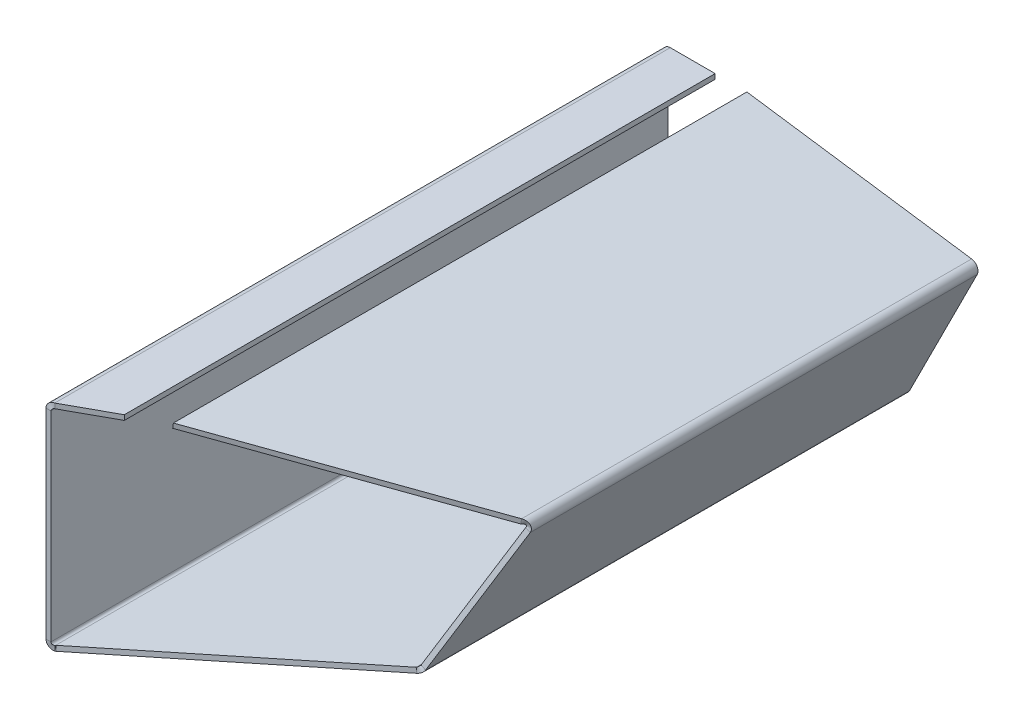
ISO-10303-21;
HEADER;
FILE_DESCRIPTION(('STEP AP214'),'2;1');
FILE_NAME('part.step','',(''),(''),'','','');
FILE_SCHEMA(('AUTOMOTIVE_DESIGN { 1 0 10303 214 1 1 1 1 }'));
ENDSEC;
DATA;
#1=APPLICATION_CONTEXT('core data for automotive mechanical design processes');
#2=APPLICATION_PROTOCOL_DEFINITION('international standard','automotive_design',2000,#1);
#3=PRODUCT_CONTEXT('',#1,'mechanical');
#4=PRODUCT('Part','Part','',(#3));
#5=PRODUCT_RELATED_PRODUCT_CATEGORY('part','',(#4));
#6=PRODUCT_DEFINITION_FORMATION('','',#4);
#7=PRODUCT_DEFINITION_CONTEXT('part definition',#1,'design');
#8=PRODUCT_DEFINITION('design','',#6,#7);
#9=PRODUCT_DEFINITION_SHAPE('','',#8);
#10=(LENGTH_UNIT() NAMED_UNIT(*) SI_UNIT(.MILLI.,.METRE.));
#11=(NAMED_UNIT(*) PLANE_ANGLE_UNIT() SI_UNIT($,.RADIAN.));
#12=(NAMED_UNIT(*) SI_UNIT($,.STERADIAN.) SOLID_ANGLE_UNIT());
#13=UNCERTAINTY_MEASURE_WITH_UNIT(LENGTH_MEASURE(1.E-05),#10,'distance_accuracy_value','');
#14=(GEOMETRIC_REPRESENTATION_CONTEXT(3) GLOBAL_UNCERTAINTY_ASSIGNED_CONTEXT((#13)) GLOBAL_UNIT_ASSIGNED_CONTEXT((#10,
#11,#12)) REPRESENTATION_CONTEXT('',''));
#15=CARTESIAN_POINT('',(0.,0.,0.));
#16=DIRECTION('',(0.,0.,1.));
#17=DIRECTION('',(1.,0.,0.));
#18=AXIS2_PLACEMENT_3D('',#15,#16,#17);
#19=CARTESIAN_POINT('',(123.998316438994,71.6559930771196,-268.));
#20=DIRECTION('',(0.141944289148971,0.989874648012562,0.));
#21=DIRECTION('',(-0.989874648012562,0.141944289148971,0.));
#22=AXIS2_PLACEMENT_3D('',#19,#20,#21);
#23=PLANE('',#22);
#24=DIRECTION('',(0.,0.,1.));
#25=VECTOR('',#24,1.);
#26=CARTESIAN_POINT('',(31.9075204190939,84.8614657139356,-268.));
#27=LINE('',#26,#25);
#28=CARTESIAN_POINT('',(31.9075204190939,84.8614657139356,-268.));
#29=VERTEX_POINT('',#28);
#30=CARTESIAN_POINT('',(31.9075204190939,84.8614657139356,-36.5449664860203));
#31=VERTEX_POINT('',#30);
#32=EDGE_CURVE('E225',#29,#31,#27,.T.);
#33=ORIENTED_EDGE('',*,*,#32,.T.);
#34=DIRECTION('',(-0.869721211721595,0.12471473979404,0.477526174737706));
#35=VECTOR('',#34,1.);
#36=CARTESIAN_POINT('',(199.125402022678,60.8830525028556,-128.357048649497));
#37=LINE('',#36,#35);
#38=CARTESIAN_POINT('',(122.622107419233,71.8533362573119,-86.3524095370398));
#39=VERTEX_POINT('',#38);
#40=EDGE_CURVE('E50',#39,#31,#37,.T.);
#41=ORIENTED_EDGE('',*,*,#40,.F.);
#42=DIRECTION('',(0.,0.,1.));
#43=VECTOR('',#42,1.);
#44=CARTESIAN_POINT('',(122.622107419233,71.8533362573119,-268.));
#45=LINE('',#44,#43);
#46=CARTESIAN_POINT('',(122.622107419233,71.8533362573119,-268.));
#47=VERTEX_POINT('',#46);
#48=EDGE_CURVE('E231',#47,#39,#45,.T.);
#49=ORIENTED_EDGE('',*,*,#48,.F.);
#50=DIRECTION('',(-0.989874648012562,0.141944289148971,0.));
#51=VECTOR('',#50,1.);
#52=CARTESIAN_POINT('',(123.998316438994,71.6559930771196,-268.));
#53=LINE('',#52,#51);
#54=EDGE_CURVE('E200',#47,#29,#53,.T.);
#55=ORIENTED_EDGE('',*,*,#54,.T.);
#56=EDGE_LOOP('',(#33,#41,#49,#55));
#57=FACE_BOUND('',#56,.T.);
#58=ADVANCED_FACE('F35',(#57),#23,.T.);
#59=CARTESIAN_POINT('',(122.196274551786,68.8837123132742,-268.));
#60=DIRECTION('',(0.,0.,1.));
#61=DIRECTION('',(1.,0.,0.));
#62=AXIS2_PLACEMENT_3D('',#59,#60,#61);
#63=CYLINDRICAL_SURFACE('',#62,3.);
#64=ORIENTED_EDGE('',*,*,#48,.T.);
#65=CARTESIAN_POINT('',(122.196274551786,68.8837123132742,-86.1186031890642));
#66=DIRECTION('',(-0.481283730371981,0.,-0.876564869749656));
#67=DIRECTION('',(-0.876564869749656,0.,0.481283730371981));
#68=AXIS2_PLACEMENT_3D('',#65,#66,#67);
#69=ELLIPSE('',#68,3.42245064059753,3.);
#70=CARTESIAN_POINT('',(124.87621874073,67.5354174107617,-87.590044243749));
#71=VERTEX_POINT('',#70);
#72=EDGE_CURVE('E190',#71,#39,#69,.F.);
#73=ORIENTED_EDGE('',*,*,#72,.F.);
#74=DIRECTION('',(0.,0.,1.));
#75=VECTOR('',#74,1.);
#76=CARTESIAN_POINT('',(124.87621874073,67.5354174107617,-268.));
#77=LINE('',#76,#75);
#78=CARTESIAN_POINT('',(124.87621874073,67.5354174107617,-268.));
#79=VERTEX_POINT('',#78);
#80=EDGE_CURVE('E307',#79,#71,#77,.T.);
#81=ORIENTED_EDGE('',*,*,#80,.F.);
#82=CARTESIAN_POINT('',(122.196274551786,68.8837123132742,-268.));
#83=DIRECTION('',(0.,0.,1.));
#84=DIRECTION('',(1.,0.,0.));
#85=AXIS2_PLACEMENT_3D('',#82,#83,#84);
#86=CIRCLE('',#85,3.);
#87=EDGE_CURVE('E228',#79,#47,#86,.T.);
#88=ORIENTED_EDGE('',*,*,#87,.T.);
#89=EDGE_LOOP('',(#64,#73,#81,#88));
#90=FACE_BOUND('',#89,.T.);
#91=ADVANCED_FACE('F471',(#90),#63,.T.);
#92=CARTESIAN_POINT('',(97.3525498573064,12.8278780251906,-268.));
#93=DIRECTION('',(0.893314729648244,-0.449431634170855,0.));
#94=DIRECTION('',(0.449431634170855,0.893314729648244,0.));
#95=AXIS2_PLACEMENT_3D('',#92,#93,#94);
#96=PLANE('',#95);
#97=ORIENTED_EDGE('',*,*,#80,.T.);
#98=DIRECTION('',(0.436343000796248,0.867299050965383,-0.239577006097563));
#99=VECTOR('',#98,1.);
#100=CARTESIAN_POINT('',(117.79198059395,53.4544008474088,-83.7003965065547));
#101=LINE('',#100,#99);
#102=CARTESIAN_POINT('',(97.5871023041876,13.2940872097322,-72.6067746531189));
#103=VERTEX_POINT('',#102);
#104=EDGE_CURVE('E199',#103,#71,#101,.T.);
#105=ORIENTED_EDGE('',*,*,#104,.F.);
#106=DIRECTION('',(0.,0.,1.));
#107=VECTOR('',#106,1.);
#108=CARTESIAN_POINT('',(97.5871023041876,13.2940872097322,-268.));
#109=LINE('',#108,#107);
#110=CARTESIAN_POINT('',(97.5871023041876,13.2940872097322,-268.));
#111=VERTEX_POINT('',#110);
#112=EDGE_CURVE('E310',#111,#103,#109,.T.);
#113=ORIENTED_EDGE('',*,*,#112,.F.);
#114=DIRECTION('',(0.449431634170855,0.893314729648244,0.));
#115=VECTOR('',#114,1.);
#116=CARTESIAN_POINT('',(97.3525498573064,12.8278780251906,-268.));
#117=LINE('',#116,#115);
#118=EDGE_CURVE('E300',#111,#79,#117,.T.);
#119=ORIENTED_EDGE('',*,*,#118,.T.);
#120=EDGE_LOOP('',(#97,#105,#113,#119));
#121=FACE_BOUND('',#120,.T.);
#122=ADVANCED_FACE('F477',(#121),#96,.T.);
#123=CARTESIAN_POINT('',(94.9071581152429,14.6423821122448,-268.));
#124=DIRECTION('',(0.,0.,1.));
#125=DIRECTION('',(1.,0.,0.));
#126=AXIS2_PLACEMENT_3D('',#123,#124,#125);
#127=CYLINDRICAL_SURFACE('',#126,3.);
#128=ORIENTED_EDGE('',*,*,#112,.T.);
#129=CARTESIAN_POINT('',(94.9071581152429,14.6423821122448,-71.1353335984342));
#130=DIRECTION('',(-0.481283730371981,0.,-0.876564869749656));
#131=DIRECTION('',(-0.876564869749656,0.,0.481283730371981));
#132=AXIS2_PLACEMENT_3D('',#129,#130,#131);
#133=ELLIPSE('',#132,3.42245064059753,3.);
#134=CARTESIAN_POINT('',(95.3336896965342,11.6728584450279,-71.3695235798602));
#135=VERTEX_POINT('',#134);
#136=EDGE_CURVE('E519',#135,#103,#133,.F.);
#137=ORIENTED_EDGE('',*,*,#136,.F.);
#138=DIRECTION('',(0.,0.,1.));
#139=VECTOR('',#138,1.);
#140=CARTESIAN_POINT('',(95.3336896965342,11.6728584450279,-268.));
#141=LINE('',#140,#139);
#142=CARTESIAN_POINT('',(95.3336896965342,11.6728584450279,-268.));
#143=VERTEX_POINT('',#142);
#144=EDGE_CURVE('E313',#143,#135,#141,.T.);
#145=ORIENTED_EDGE('',*,*,#144,.F.);
#146=CARTESIAN_POINT('',(94.9071581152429,14.6423821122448,-268.));
#147=DIRECTION('',(0.,0.,1.));
#148=DIRECTION('',(1.,0.,0.));
#149=AXIS2_PLACEMENT_3D('',#146,#147,#148);
#150=CIRCLE('',#149,3.);
#151=EDGE_CURVE('E297',#143,#111,#150,.T.);
#152=ORIENTED_EDGE('',*,*,#151,.T.);
#153=EDGE_LOOP('',(#128,#137,#145,#152));
#154=FACE_BOUND('',#153,.T.);
#155=ADVANCED_FACE('F608',(#154),#127,.T.);
#156=CARTESIAN_POINT('',(0.284354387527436,-1.97968244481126,-268.));
#157=DIRECTION('',(0.142177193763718,-0.989841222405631,0.));
#158=DIRECTION('',(0.989841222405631,0.142177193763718,0.));
#159=AXIS2_PLACEMENT_3D('',#156,#157,#158);
#160=PLANE('',#159);
#161=ORIENTED_EDGE('',*,*,#144,.T.);
#162=DIRECTION('',(0.869698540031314,0.124920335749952,-0.477513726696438));
#163=VECTOR('',#162,1.);
#164=CARTESIAN_POINT('',(103.616701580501,12.8626001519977,-75.9173659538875));
#165=LINE('',#164,#163);
#166=CARTESIAN_POINT('',(1.42653158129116,-1.81562426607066,-19.8091782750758));
#167=VERTEX_POINT('',#166);
#168=EDGE_CURVE('E359',#167,#135,#165,.T.);
#169=ORIENTED_EDGE('',*,*,#168,.F.);
#170=DIRECTION('',(0.,0.,1.));
#171=VECTOR('',#170,1.);
#172=CARTESIAN_POINT('',(1.42653158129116,-1.81562426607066,-268.));
#173=LINE('',#172,#171);
#174=CARTESIAN_POINT('',(1.42653158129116,-1.81562426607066,-268.));
#175=VERTEX_POINT('',#174);
#176=EDGE_CURVE('E316',#175,#167,#173,.T.);
#177=ORIENTED_EDGE('',*,*,#176,.F.);
#178=DIRECTION('',(0.989841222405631,0.142177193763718,0.));
#179=VECTOR('',#178,1.);
#180=CARTESIAN_POINT('',(0.284354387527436,-1.97968244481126,-268.));
#181=LINE('',#180,#179);
#182=EDGE_CURVE('E294',#175,#143,#181,.T.);
#183=ORIENTED_EDGE('',*,*,#182,.T.);
#184=EDGE_LOOP('',(#161,#169,#177,#183));
#185=FACE_BOUND('',#184,.T.);
#186=ADVANCED_FACE('F529',(#185),#160,.T.);
#187=CARTESIAN_POINT('',(1.,1.15389940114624,-268.));
#188=DIRECTION('',(0.,0.,1.));
#189=DIRECTION('',(1.,0.,0.));
#190=AXIS2_PLACEMENT_3D('',#187,#188,#189);
#191=CYLINDRICAL_SURFACE('',#190,3.);
#192=ORIENTED_EDGE('',*,*,#176,.T.);
#193=CARTESIAN_POINT('',(1.,1.15389940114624,-19.5749882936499));
#194=DIRECTION('',(-0.481283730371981,0.,-0.876564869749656));
#195=DIRECTION('',(-0.876564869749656,0.,0.481283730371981));
#196=AXIS2_PLACEMENT_3D('',#193,#194,#195);
#197=ELLIPSE('',#196,3.42245064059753,3.);
#198=CARTESIAN_POINT('',(1.00000000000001,-1.84610059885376,-19.5749882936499));
#199=VERTEX_POINT('',#198);
#200=EDGE_CURVE('E398',#199,#167,#197,.F.);
#201=ORIENTED_EDGE('',*,*,#200,.F.);
#202=CARTESIAN_POINT('',(1.,1.15389940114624,-19.5749882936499));
#203=DIRECTION('',(-0.180028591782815,0.,-0.983661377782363));
#204=DIRECTION('',(-0.983661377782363,0.,0.180028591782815));
#205=AXIS2_PLACEMENT_3D('',#202,#203,#204);
#206=ELLIPSE('',#205,3.04983002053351,3.);
#207=CARTESIAN_POINT('',(-2.,1.15389940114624,-19.0259316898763));
#208=VERTEX_POINT('',#207);
#209=EDGE_CURVE('E534',#208,#199,#206,.F.);
#210=ORIENTED_EDGE('',*,*,#209,.F.);
#211=DIRECTION('',(0.,0.,1.));
#212=VECTOR('',#211,1.);
#213=CARTESIAN_POINT('',(-2.,1.15389940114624,-268.));
#214=LINE('',#213,#212);
#215=CARTESIAN_POINT('',(-2.,1.15389940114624,-268.));
#216=VERTEX_POINT('',#215);
#217=EDGE_CURVE('E319',#216,#208,#214,.T.);
#218=ORIENTED_EDGE('',*,*,#217,.F.);
#219=CARTESIAN_POINT('',(1.,1.15389940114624,-268.));
#220=DIRECTION('',(0.,0.,1.));
#221=DIRECTION('',(1.,0.,0.));
#222=AXIS2_PLACEMENT_3D('',#219,#220,#221);
#223=CIRCLE('',#222,3.);
#224=EDGE_CURVE('E291',#216,#175,#223,.T.);
#225=ORIENTED_EDGE('',*,*,#224,.T.);
#226=EDGE_LOOP('',(#192,#201,#210,#218,#225));
#227=FACE_BOUND('',#226,.T.);
#228=ADVANCED_FACE('F533',(#227),#191,.T.);
#229=CARTESIAN_POINT('',(-2.,82.8817164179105,-268.));
#230=DIRECTION('',(-1.,0.,0.));
#231=DIRECTION('',(0.,0.,1.));
#232=AXIS2_PLACEMENT_3D('',#229,#230,#231);
#233=PLANE('',#232);
#234=ORIENTED_EDGE('',*,*,#217,.T.);
#235=DIRECTION('',(0.,1.,0.));
#236=VECTOR('',#235,1.);
#237=CARTESIAN_POINT('',(-2.,82.8817164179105,-19.0259316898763));
#238=LINE('',#237,#236);
#239=CARTESIAN_POINT('',(-2.,81.8817164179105,-19.0259316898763));
#240=VERTEX_POINT('',#239);
#241=EDGE_CURVE('E425',#240,#208,#238,.F.);
#242=ORIENTED_EDGE('',*,*,#241,.F.);
#243=DIRECTION('',(0.,0.,1.));
#244=VECTOR('',#243,1.);
#245=CARTESIAN_POINT('',(-2.,81.8817164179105,-268.));
#246=LINE('',#245,#244);
#247=CARTESIAN_POINT('',(-2.,81.8817164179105,-268.));
#248=VERTEX_POINT('',#247);
#249=EDGE_CURVE('E322',#248,#240,#246,.T.);
#250=ORIENTED_EDGE('',*,*,#249,.F.);
#251=DIRECTION('',(0.,1.,0.));
#252=VECTOR('',#251,1.);
#253=CARTESIAN_POINT('',(-2.,82.8817164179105,-268.));
#254=LINE('',#253,#252);
#255=EDGE_CURVE('E249',#248,#216,#254,.F.);
#256=ORIENTED_EDGE('',*,*,#255,.T.);
#257=EDGE_LOOP('',(#234,#242,#250,#256));
#258=FACE_BOUND('',#257,.T.);
#259=ADVANCED_FACE('F439',(#258),#233,.T.);
#260=CARTESIAN_POINT('',(1.,81.8817164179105,-268.));
#261=DIRECTION('',(0.,0.,1.));
#262=DIRECTION('',(1.,0.,0.));
#263=AXIS2_PLACEMENT_3D('',#260,#261,#262);
#264=CYLINDRICAL_SURFACE('',#263,3.);
#265=ORIENTED_EDGE('',*,*,#249,.T.);
#266=CARTESIAN_POINT('',(1.,81.8817164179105,-19.5749882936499));
#267=DIRECTION('',(-0.180028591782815,0.,-0.983661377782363));
#268=DIRECTION('',(-0.983661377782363,0.,0.180028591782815));
#269=AXIS2_PLACEMENT_3D('',#266,#267,#268);
#270=ELLIPSE('',#269,3.04983002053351,3.);
#271=CARTESIAN_POINT('',(1.,84.8817164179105,-19.5749882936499));
#272=VERTEX_POINT('',#271);
#273=EDGE_CURVE('E400',#272,#240,#270,.F.);
#274=ORIENTED_EDGE('',*,*,#273,.F.);
#275=DIRECTION('',(0.,0.,1.));
#276=VECTOR('',#275,1.);
#277=CARTESIAN_POINT('',(1.,84.8817164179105,-268.));
#278=LINE('',#277,#276);
#279=CARTESIAN_POINT('',(1.,84.8817164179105,-268.));
#280=VERTEX_POINT('',#279);
#281=EDGE_CURVE('E325',#280,#272,#278,.T.);
#282=ORIENTED_EDGE('',*,*,#281,.F.);
#283=CARTESIAN_POINT('',(1.,81.8817164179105,-268.));
#284=DIRECTION('',(0.,0.,1.));
#285=DIRECTION('',(1.,0.,0.));
#286=AXIS2_PLACEMENT_3D('',#283,#284,#285);
#287=CIRCLE('',#286,3.);
#288=EDGE_CURVE('E288',#280,#248,#287,.T.);
#289=ORIENTED_EDGE('',*,*,#288,.T.);
#290=EDGE_LOOP('',(#265,#274,#282,#289));
#291=FACE_BOUND('',#290,.T.);
#292=ADVANCED_FACE('F443',(#291),#264,.T.);
#293=CARTESIAN_POINT('',(19.113184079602,84.8817164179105,-268.));
#294=DIRECTION('',(0.,1.,0.));
#295=DIRECTION('',(0.,0.,1.));
#296=AXIS2_PLACEMENT_3D('',#293,#294,#295);
#297=PLANE('',#296);
#298=ORIENTED_EDGE('',*,*,#281,.T.);
#299=DIRECTION('',(-0.876564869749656,0.,0.481283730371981));
#300=VECTOR('',#299,1.);
#301=CARTESIAN_POINT('',(119.722206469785,84.8817164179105,-84.7601997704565));
#302=LINE('',#301,#300);
#303=CARTESIAN_POINT('',(19.113184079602,84.8817164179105,-29.5201516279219));
#304=VERTEX_POINT('',#303);
#305=EDGE_CURVE('E412',#304,#272,#302,.T.);
#306=ORIENTED_EDGE('',*,*,#305,.F.);
#307=DIRECTION('',(0.,0.,1.));
#308=VECTOR('',#307,1.);
#309=CARTESIAN_POINT('',(19.113184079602,84.8817164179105,-268.));
#310=LINE('',#309,#308);
#311=CARTESIAN_POINT('',(19.113184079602,84.8817164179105,-268.));
#312=VERTEX_POINT('',#311);
#313=EDGE_CURVE('E328',#312,#304,#310,.T.);
#314=ORIENTED_EDGE('',*,*,#313,.F.);
#315=DIRECTION('',(1.,0.,0.));
#316=VECTOR('',#315,1.);
#317=CARTESIAN_POINT('',(19.113184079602,84.8817164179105,-268.));
#318=LINE('',#317,#316);
#319=EDGE_CURVE('E285',#312,#280,#318,.F.);
#320=ORIENTED_EDGE('',*,*,#319,.T.);
#321=EDGE_LOOP('',(#298,#306,#314,#320));
#322=FACE_BOUND('',#321,.T.);
#323=ADVANCED_FACE('F447',(#322),#297,.T.);
#324=CARTESIAN_POINT('',(19.113184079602,84.8817164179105,-268.));
#325=DIRECTION('',(-1.,0.,0.));
#326=DIRECTION('',(0.,0.,1.));
#327=AXIS2_PLACEMENT_3D('',#324,#325,#326);
#328=PLANE('',#327);
#329=DIRECTION('',(0.,1.,0.));
#330=VECTOR('',#329,1.);
#331=CARTESIAN_POINT('',(19.113184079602,84.8817164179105,-29.5201516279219));
#332=LINE('',#331,#330);
#333=CARTESIAN_POINT('',(19.113184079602,82.8817164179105,-29.5201516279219));
#334=VERTEX_POINT('',#333);
#335=EDGE_CURVE('E417',#304,#334,#332,.F.);
#336=ORIENTED_EDGE('',*,*,#335,.T.);
#337=DIRECTION('',(0.,0.,1.));
#338=VECTOR('',#337,1.);
#339=CARTESIAN_POINT('',(19.113184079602,82.8817164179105,-268.));
#340=LINE('',#339,#338);
#341=CARTESIAN_POINT('',(19.113184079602,82.8817164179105,-268.));
#342=VERTEX_POINT('',#341);
#343=EDGE_CURVE('E331',#342,#334,#340,.T.);
#344=ORIENTED_EDGE('',*,*,#343,.F.);
#345=DIRECTION('',(0.,-1.,0.));
#346=VECTOR('',#345,1.);
#347=CARTESIAN_POINT('',(19.113184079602,84.8817164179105,-268.));
#348=LINE('',#347,#346);
#349=EDGE_CURVE('E283',#312,#342,#348,.T.);
#350=ORIENTED_EDGE('',*,*,#349,.F.);
#351=ORIENTED_EDGE('',*,*,#313,.T.);
#352=EDGE_LOOP('',(#336,#344,#350,#351));
#353=FACE_BOUND('',#352,.T.);
#354=ADVANCED_FACE('F461',(#353),#328,.F.);
#355=CARTESIAN_POINT('',(19.113184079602,82.8817164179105,-268.));
#356=DIRECTION('',(0.,1.,0.));
#357=DIRECTION('',(0.,0.,1.));
#358=AXIS2_PLACEMENT_3D('',#355,#356,#357);
#359=PLANE('',#358);
#360=DIRECTION('',(-0.876564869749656,0.,0.481283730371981));
#361=VECTOR('',#360,1.);
#362=CARTESIAN_POINT('',(119.722206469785,82.8817164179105,-84.7601997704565));
#363=LINE('',#362,#361);
#364=CARTESIAN_POINT('',(1.,82.8817164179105,-19.5749882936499));
#365=VERTEX_POINT('',#364);
#366=EDGE_CURVE('E414',#334,#365,#363,.T.);
#367=ORIENTED_EDGE('',*,*,#366,.T.);
#368=DIRECTION('',(0.,0.,1.));
#369=VECTOR('',#368,1.);
#370=CARTESIAN_POINT('',(1.,82.8817164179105,-268.));
#371=LINE('',#370,#369);
#372=CARTESIAN_POINT('',(1.,82.8817164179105,-268.));
#373=VERTEX_POINT('',#372);
#374=EDGE_CURVE('E269',#373,#365,#371,.T.);
#375=ORIENTED_EDGE('',*,*,#374,.F.);
#376=DIRECTION('',(-1.,0.,0.));
#377=VECTOR('',#376,1.);
#378=CARTESIAN_POINT('',(19.113184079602,82.8817164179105,-268.));
#379=LINE('',#378,#377);
#380=EDGE_CURVE('E260',#342,#373,#379,.T.);
#381=ORIENTED_EDGE('',*,*,#380,.F.);
#382=ORIENTED_EDGE('',*,*,#343,.T.);
#383=EDGE_LOOP('',(#367,#375,#381,#382));
#384=FACE_BOUND('',#383,.T.);
#385=ADVANCED_FACE('F456',(#384),#359,.F.);
#386=CARTESIAN_POINT('',(1.,81.8817164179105,-268.));
#387=DIRECTION('',(0.,0.,1.));
#388=DIRECTION('',(1.,0.,0.));
#389=AXIS2_PLACEMENT_3D('',#386,#387,#388);
#390=CYLINDRICAL_SURFACE('',#389,1.);
#391=CARTESIAN_POINT('',(1.,81.8817164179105,-19.5749882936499));
#392=DIRECTION('',(-0.481283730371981,0.,-0.876564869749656));
#393=DIRECTION('',(-0.876564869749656,0.,0.481283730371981));
#394=AXIS2_PLACEMENT_3D('',#391,#392,#393);
#395=ELLIPSE('',#394,1.14081688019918,1.);
#396=CARTESIAN_POINT('',(0.,81.8817164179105,-19.0259316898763));
#397=VERTEX_POINT('',#396);
#398=EDGE_CURVE('E266',#365,#397,#395,.F.);
#399=ORIENTED_EDGE('',*,*,#398,.T.);
#400=DIRECTION('',(0.,0.,1.));
#401=VECTOR('',#400,1.);
#402=CARTESIAN_POINT('',(0.,81.8817164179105,-268.));
#403=LINE('',#402,#401);
#404=CARTESIAN_POINT('',(0.,81.8817164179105,-268.));
#405=VERTEX_POINT('',#404);
#406=EDGE_CURVE('E264',#405,#397,#403,.T.);
#407=ORIENTED_EDGE('',*,*,#406,.F.);
#408=CARTESIAN_POINT('',(1.,81.8817164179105,-268.));
#409=DIRECTION('',(0.,0.,-1.));
#410=DIRECTION('',(-1.,0.,0.));
#411=AXIS2_PLACEMENT_3D('',#408,#409,#410);
#412=CIRCLE('',#411,1.);
#413=EDGE_CURVE('E255',#373,#405,#412,.F.);
#414=ORIENTED_EDGE('',*,*,#413,.F.);
#415=ORIENTED_EDGE('',*,*,#374,.T.);
#416=EDGE_LOOP('',(#399,#407,#414,#415));
#417=FACE_BOUND('',#416,.T.);
#418=ADVANCED_FACE('F265',(#417),#390,.F.);
#419=CARTESIAN_POINT('',(0.,82.8817164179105,-268.));
#420=DIRECTION('',(-1.,0.,0.));
#421=DIRECTION('',(0.,0.,1.));
#422=AXIS2_PLACEMENT_3D('',#419,#420,#421);
#423=PLANE('',#422);
#424=DIRECTION('',(0.,-1.,0.));
#425=VECTOR('',#424,1.);
#426=CARTESIAN_POINT('',(0.,82.8817164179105,-19.0259316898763));
#427=LINE('',#426,#425);
#428=CARTESIAN_POINT('',(0.,1.15389940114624,-19.0259316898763));
#429=VERTEX_POINT('',#428);
#430=EDGE_CURVE('E422',#397,#429,#427,.T.);
#431=ORIENTED_EDGE('',*,*,#430,.T.);
#432=DIRECTION('',(0.,0.,1.));
#433=VECTOR('',#432,1.);
#434=CARTESIAN_POINT('',(0.,1.15389940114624,-268.));
#435=LINE('',#434,#433);
#436=CARTESIAN_POINT('',(0.,1.15389940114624,-268.));
#437=VERTEX_POINT('',#436);
#438=EDGE_CURVE('E270',#437,#429,#435,.T.);
#439=ORIENTED_EDGE('',*,*,#438,.F.);
#440=DIRECTION('',(0.,-1.,0.));
#441=VECTOR('',#440,1.);
#442=CARTESIAN_POINT('',(0.,82.8817164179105,-268.));
#443=LINE('',#442,#441);
#444=EDGE_CURVE('E246',#405,#437,#443,.T.);
#445=ORIENTED_EDGE('',*,*,#444,.F.);
#446=ORIENTED_EDGE('',*,*,#406,.T.);
#447=EDGE_LOOP('',(#431,#439,#445,#446));
#448=FACE_BOUND('',#447,.T.);
#449=ADVANCED_FACE('F272',(#448),#423,.F.);
#450=CARTESIAN_POINT('',(1.,1.15389940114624,-268.));
#451=DIRECTION('',(0.,0.,1.));
#452=DIRECTION('',(1.,0.,0.));
#453=AXIS2_PLACEMENT_3D('',#450,#451,#452);
#454=CYLINDRICAL_SURFACE('',#453,1.);
#455=CARTESIAN_POINT('',(1.,1.15389940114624,-19.5749882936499));
#456=DIRECTION('',(-0.854803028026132,0.,-0.518952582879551));
#457=DIRECTION('',(-0.518952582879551,0.,0.854803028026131));
#458=AXIS2_PLACEMENT_3D('',#455,#456,#457);
#459=ELLIPSE('',#458,1.92695832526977,1.);
#460=CARTESIAN_POINT('',(1.00000000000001,0.15389940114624,-19.5749882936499));
#461=VERTEX_POINT('',#460);
#462=CARTESIAN_POINT('',(1.14217719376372,0.164058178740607,-19.8091782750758));
#463=VERTEX_POINT('',#462);
#464=EDGE_CURVE('E394',#461,#463,#459,.F.);
#465=ORIENTED_EDGE('',*,*,#464,.T.);
#466=DIRECTION('',(0.,0.,1.));
#467=VECTOR('',#466,1.);
#468=CARTESIAN_POINT('',(1.14217719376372,0.164058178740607,-268.));
#469=LINE('',#468,#467);
#470=CARTESIAN_POINT('',(1.14217719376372,0.164058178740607,-268.));
#471=VERTEX_POINT('',#470);
#472=EDGE_CURVE('E336',#471,#463,#469,.T.);
#473=ORIENTED_EDGE('',*,*,#472,.F.);
#474=CARTESIAN_POINT('',(1.,1.15389940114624,-268.));
#475=DIRECTION('',(0.,0.,-1.));
#476=DIRECTION('',(-1.,0.,0.));
#477=AXIS2_PLACEMENT_3D('',#474,#475,#476);
#478=CIRCLE('',#477,1.);
#479=EDGE_CURVE('E275',#437,#471,#478,.F.);
#480=ORIENTED_EDGE('',*,*,#479,.F.);
#481=ORIENTED_EDGE('',*,*,#438,.T.);
#482=CARTESIAN_POINT('',(1.,1.15389940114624,-19.5749882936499));
#483=DIRECTION('',(-0.481283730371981,0.,-0.876564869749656));
#484=DIRECTION('',(-0.876564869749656,0.,0.481283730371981));
#485=AXIS2_PLACEMENT_3D('',#482,#483,#484);
#486=ELLIPSE('',#485,1.14081688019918,1.);
#487=EDGE_CURVE('E395',#429,#461,#486,.F.);
#488=ORIENTED_EDGE('',*,*,#487,.T.);
#489=EDGE_LOOP('',(#465,#473,#480,#481,#488));
#490=FACE_BOUND('',#489,.T.);
#491=ADVANCED_FACE('F392',(#490),#454,.F.);
#492=CARTESIAN_POINT('',(0.,0.,-268.));
#493=DIRECTION('',(0.142177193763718,-0.989841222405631,0.));
#494=DIRECTION('',(0.989841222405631,0.142177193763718,0.));
#495=AXIS2_PLACEMENT_3D('',#492,#493,#494);
#496=PLANE('',#495);
#497=DIRECTION('',(0.869698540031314,0.124920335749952,-0.477513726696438));
#498=VECTOR('',#497,1.);
#499=CARTESIAN_POINT('',(103.332347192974,14.842282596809,-75.9173659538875));
#500=LINE('',#499,#498);
#501=CARTESIAN_POINT('',(95.0493353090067,13.6525408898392,-71.3695235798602));
#502=VERTEX_POINT('',#501);
#503=EDGE_CURVE('E352',#463,#502,#500,.T.);
#504=ORIENTED_EDGE('',*,*,#503,.T.);
#505=DIRECTION('',(0.,0.,1.));
#506=VECTOR('',#505,1.);
#507=CARTESIAN_POINT('',(95.0493353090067,13.6525408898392,-268.));
#508=LINE('',#507,#506);
#509=CARTESIAN_POINT('',(95.0493353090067,13.6525408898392,-268.));
#510=VERTEX_POINT('',#509);
#511=EDGE_CURVE('E217',#510,#502,#508,.T.);
#512=ORIENTED_EDGE('',*,*,#511,.F.);
#513=DIRECTION('',(0.989841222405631,0.142177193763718,0.));
#514=VECTOR('',#513,1.);
#515=CARTESIAN_POINT('',(0.,0.,-268.));
#516=LINE('',#515,#514);
#517=EDGE_CURVE('E278',#471,#510,#516,.T.);
#518=ORIENTED_EDGE('',*,*,#517,.F.);
#519=ORIENTED_EDGE('',*,*,#472,.T.);
#520=EDGE_LOOP('',(#504,#512,#518,#519));
#521=FACE_BOUND('',#520,.T.);
#522=ADVANCED_FACE('F350',(#521),#496,.F.);
#523=CARTESIAN_POINT('',(94.9071581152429,14.6423821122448,-268.));
#524=DIRECTION('',(0.,0.,1.));
#525=DIRECTION('',(1.,0.,0.));
#526=AXIS2_PLACEMENT_3D('',#523,#524,#525);
#527=CYLINDRICAL_SURFACE('',#526,1.);
#528=CARTESIAN_POINT('',(94.9071581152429,14.6423821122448,-71.1353335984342));
#529=DIRECTION('',(-0.854803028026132,0.,-0.51895258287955));
#530=DIRECTION('',(-0.51895258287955,0.,0.854803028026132));
#531=AXIS2_PLACEMENT_3D('',#528,#529,#530);
#532=ELLIPSE('',#531,1.92695832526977,1.);
#533=CARTESIAN_POINT('',(95.8004728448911,14.1929504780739,-72.6067746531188));
#534=VERTEX_POINT('',#533);
#535=EDGE_CURVE('E344',#502,#534,#532,.F.);
#536=ORIENTED_EDGE('',*,*,#535,.T.);
#537=DIRECTION('',(0.,0.,1.));
#538=VECTOR('',#537,1.);
#539=CARTESIAN_POINT('',(95.8004728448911,14.1929504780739,-268.));
#540=LINE('',#539,#538);
#541=CARTESIAN_POINT('',(95.8004728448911,14.1929504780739,-268.));
#542=VERTEX_POINT('',#541);
#543=EDGE_CURVE('E211',#542,#534,#540,.T.);
#544=ORIENTED_EDGE('',*,*,#543,.F.);
#545=CARTESIAN_POINT('',(94.9071581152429,14.6423821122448,-268.));
#546=DIRECTION('',(0.,0.,-1.));
#547=DIRECTION('',(-1.,0.,0.));
#548=AXIS2_PLACEMENT_3D('',#545,#546,#547);
#549=CIRCLE('',#548,1.);
#550=EDGE_CURVE('E346',#510,#542,#549,.F.);
#551=ORIENTED_EDGE('',*,*,#550,.F.);
#552=ORIENTED_EDGE('',*,*,#511,.T.);
#553=EDGE_LOOP('',(#536,#544,#551,#552));
#554=FACE_BOUND('',#553,.T.);
#555=ADVANCED_FACE('F343',(#554),#527,.F.);
#556=CARTESIAN_POINT('',(95.5659203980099,13.7267412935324,-268.));
#557=DIRECTION('',(0.893314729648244,-0.449431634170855,0.));
#558=DIRECTION('',(0.449431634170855,0.893314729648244,0.));
#559=AXIS2_PLACEMENT_3D('',#556,#557,#558);
#560=PLANE('',#559);
#561=DIRECTION('',(0.436343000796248,0.867299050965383,-0.239577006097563));
#562=VECTOR('',#561,1.);
#563=CARTESIAN_POINT('',(116.005351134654,54.3532641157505,-83.7003965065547));
#564=LINE('',#563,#562);
#565=CARTESIAN_POINT('',(123.089589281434,68.4342806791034,-87.590044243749));
#566=VERTEX_POINT('',#565);
#567=EDGE_CURVE('E196',#534,#566,#564,.T.);
#568=ORIENTED_EDGE('',*,*,#567,.T.);
#569=DIRECTION('',(0.,0.,1.));
#570=VECTOR('',#569,1.);
#571=CARTESIAN_POINT('',(123.089589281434,68.4342806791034,-268.));
#572=LINE('',#571,#570);
#573=CARTESIAN_POINT('',(123.089589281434,68.4342806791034,-268.));
#574=VERTEX_POINT('',#573);
#575=EDGE_CURVE('E208',#574,#566,#572,.T.);
#576=ORIENTED_EDGE('',*,*,#575,.F.);
#577=DIRECTION('',(0.449431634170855,0.893314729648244,0.));
#578=VECTOR('',#577,1.);
#579=CARTESIAN_POINT('',(95.5659203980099,13.7267412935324,-268.));
#580=LINE('',#579,#578);
#581=EDGE_CURVE('E379',#542,#574,#580,.T.);
#582=ORIENTED_EDGE('',*,*,#581,.F.);
#583=ORIENTED_EDGE('',*,*,#543,.T.);
#584=EDGE_LOOP('',(#568,#576,#582,#583));
#585=FACE_BOUND('',#584,.T.);
#586=ADVANCED_FACE('F206',(#585),#560,.F.);
#587=CARTESIAN_POINT('',(122.196274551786,68.8837123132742,-268.));
#588=DIRECTION('',(0.,0.,1.));
#589=DIRECTION('',(1.,0.,0.));
#590=AXIS2_PLACEMENT_3D('',#587,#588,#589);
#591=CYLINDRICAL_SURFACE('',#590,1.);
#592=CARTESIAN_POINT('',(122.196274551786,68.8837123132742,-86.1186031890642));
#593=DIRECTION('',(-0.854803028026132,0.,-0.51895258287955));
#594=DIRECTION('',(-0.51895258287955,0.,0.854803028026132));
#595=AXIS2_PLACEMENT_3D('',#592,#593,#594);
#596=ELLIPSE('',#595,1.92695832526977,1.);
#597=CARTESIAN_POINT('',(122.338218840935,69.8735869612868,-86.3524095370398));
#598=VERTEX_POINT('',#597);
#599=EDGE_CURVE('E180',#566,#598,#596,.F.);
#600=ORIENTED_EDGE('',*,*,#599,.T.);
#601=DIRECTION('',(0.,0.,1.));
#602=VECTOR('',#601,1.);
#603=CARTESIAN_POINT('',(122.338218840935,69.8735869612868,-268.));
#604=LINE('',#603,#602);
#605=CARTESIAN_POINT('',(122.338218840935,69.8735869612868,-268.));
#606=VERTEX_POINT('',#605);
#607=EDGE_CURVE('E215',#606,#598,#604,.T.);
#608=ORIENTED_EDGE('',*,*,#607,.F.);
#609=CARTESIAN_POINT('',(122.196274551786,68.8837123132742,-268.));
#610=DIRECTION('',(0.,0.,-1.));
#611=DIRECTION('',(-1.,0.,0.));
#612=AXIS2_PLACEMENT_3D('',#609,#610,#611);
#613=CIRCLE('',#612,1.);
#614=EDGE_CURVE('E214',#574,#606,#613,.F.);
#615=ORIENTED_EDGE('',*,*,#614,.F.);
#616=ORIENTED_EDGE('',*,*,#575,.T.);
#617=EDGE_LOOP('',(#600,#608,#615,#616));
#618=FACE_BOUND('',#617,.T.);
#619=ADVANCED_FACE('F213',(#618),#591,.F.);
#620=CARTESIAN_POINT('',(123.714427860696,69.6762437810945,-268.));
#621=DIRECTION('',(0.141944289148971,0.989874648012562,0.));
#622=DIRECTION('',(-0.989874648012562,0.141944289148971,0.));
#623=AXIS2_PLACEMENT_3D('',#620,#621,#622);
#624=PLANE('',#623);
#625=DIRECTION('',(-0.869721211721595,0.12471473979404,0.477526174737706));
#626=VECTOR('',#625,1.);
#627=CARTESIAN_POINT('',(198.84151344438,58.9033032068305,-128.357048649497));
#628=LINE('',#627,#626);
#629=CARTESIAN_POINT('',(31.623631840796,82.8817164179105,-36.5449664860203));
#630=VERTEX_POINT('',#629);
#631=EDGE_CURVE('E539',#598,#630,#628,.T.);
#632=ORIENTED_EDGE('',*,*,#631,.T.);
#633=DIRECTION('',(0.,0.,1.));
#634=VECTOR('',#633,1.);
#635=CARTESIAN_POINT('',(31.623631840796,82.8817164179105,-268.));
#636=LINE('',#635,#634);
#637=CARTESIAN_POINT('',(31.623631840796,82.8817164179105,-268.));
#638=VERTEX_POINT('',#637);
#639=EDGE_CURVE('E219',#638,#630,#636,.T.);
#640=ORIENTED_EDGE('',*,*,#639,.F.);
#641=DIRECTION('',(-0.989874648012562,0.141944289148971,0.));
#642=VECTOR('',#641,1.);
#643=CARTESIAN_POINT('',(123.714427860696,69.6762437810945,-268.));
#644=LINE('',#643,#642);
#645=EDGE_CURVE('E376',#606,#638,#644,.T.);
#646=ORIENTED_EDGE('',*,*,#645,.F.);
#647=ORIENTED_EDGE('',*,*,#607,.T.);
#648=EDGE_LOOP('',(#632,#640,#646,#647));
#649=FACE_BOUND('',#648,.T.);
#650=ADVANCED_FACE('F508',(#649),#624,.F.);
#651=CARTESIAN_POINT('',(31.623631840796,82.8817164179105,-268.));
#652=DIRECTION('',(0.989874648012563,-0.14194428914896,0.));
#653=DIRECTION('',(0.14194428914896,0.989874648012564,0.));
#654=AXIS2_PLACEMENT_3D('',#651,#652,#653);
#655=PLANE('',#654);
#656=DIRECTION('',(0.141944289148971,0.989874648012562,0.));
#657=VECTOR('',#656,1.);
#658=CARTESIAN_POINT('',(31.9075204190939,84.8614657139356,-36.5449664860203));
#659=LINE('',#658,#657);
#660=EDGE_CURVE('E515',#31,#630,#659,.F.);
#661=ORIENTED_EDGE('',*,*,#660,.F.);
#662=ORIENTED_EDGE('',*,*,#32,.F.);
#663=DIRECTION('',(0.14194428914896,0.989874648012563,0.));
#664=VECTOR('',#663,1.);
#665=CARTESIAN_POINT('',(31.623631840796,82.8817164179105,-268.));
#666=LINE('',#665,#664);
#667=EDGE_CURVE('E374',#638,#29,#666,.T.);
#668=ORIENTED_EDGE('',*,*,#667,.F.);
#669=ORIENTED_EDGE('',*,*,#639,.T.);
#670=EDGE_LOOP('',(#661,#662,#668,#669));
#671=FACE_BOUND('',#670,.T.);
#672=ADVANCED_FACE('F482',(#671),#655,.F.);
#673=CARTESIAN_POINT('',(1.,82.8817164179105,-268.));
#674=DIRECTION('',(0.,0.,-1.));
#675=DIRECTION('',(-1.,0.,0.));
#676=AXIS2_PLACEMENT_3D('',#673,#674,#675);
#677=PLANE('',#676);
#678=DIRECTION('',(0.,1.,0.));
#679=VECTOR('',#678,1.);
#680=CARTESIAN_POINT('',(1.,82.8817164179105,-268.));
#681=LINE('',#680,#679);
#682=EDGE_CURVE('E11',#373,#280,#681,.T.);
#683=ORIENTED_EDGE('',*,*,#682,.F.);
#684=ORIENTED_EDGE('',*,*,#413,.T.);
#685=DIRECTION('',(1.,0.,0.));
#686=VECTOR('',#685,1.);
#687=CARTESIAN_POINT('',(-2.,81.8817164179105,-268.));
#688=LINE('',#687,#686);
#689=EDGE_CURVE('E43',#248,#405,#688,.T.);
#690=ORIENTED_EDGE('',*,*,#689,.F.);
#691=ORIENTED_EDGE('',*,*,#288,.F.);
#692=EDGE_LOOP('',(#683,#684,#690,#691));
#693=FACE_BOUND('',#692,.T.);
#694=ADVANCED_FACE('F37',(#693),#677,.T.);
#695=CARTESIAN_POINT('',(-2.,81.8817164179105,-268.));
#696=DIRECTION('',(0.,0.,-1.));
#697=DIRECTION('',(-1.,0.,0.));
#698=AXIS2_PLACEMENT_3D('',#695,#696,#697);
#699=PLANE('',#698);
#700=ORIENTED_EDGE('',*,*,#380,.T.);
#701=ORIENTED_EDGE('',*,*,#682,.T.);
#702=ORIENTED_EDGE('',*,*,#319,.F.);
#703=ORIENTED_EDGE('',*,*,#349,.T.);
#704=EDGE_LOOP('',(#700,#701,#702,#703));
#705=FACE_BOUND('',#704,.T.);
#706=ADVANCED_FACE('F451',(#705),#699,.T.);
#707=CARTESIAN_POINT('',(0.,1.15389940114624,-268.));
#708=DIRECTION('',(0.,0.,-1.));
#709=DIRECTION('',(-1.,0.,0.));
#710=AXIS2_PLACEMENT_3D('',#707,#708,#709);
#711=PLANE('',#710);
#712=DIRECTION('',(-1.,0.,0.));
#713=VECTOR('',#712,1.);
#714=CARTESIAN_POINT('',(0.,1.15389940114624,-268.));
#715=LINE('',#714,#713);
#716=EDGE_CURVE('E239',#437,#216,#715,.T.);
#717=ORIENTED_EDGE('',*,*,#716,.F.);
#718=ORIENTED_EDGE('',*,*,#479,.T.);
#719=DIRECTION('',(-0.142177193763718,0.989841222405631,0.));
#720=VECTOR('',#719,1.);
#721=CARTESIAN_POINT('',(1.42653158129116,-1.81562426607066,-268.));
#722=LINE('',#721,#720);
#723=EDGE_CURVE('E237',#175,#471,#722,.T.);
#724=ORIENTED_EDGE('',*,*,#723,.F.);
#725=ORIENTED_EDGE('',*,*,#224,.F.);
#726=EDGE_LOOP('',(#717,#718,#724,#725));
#727=FACE_BOUND('',#726,.T.);
#728=ADVANCED_FACE('F389',(#727),#711,.T.);
#729=CARTESIAN_POINT('',(1.42653158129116,-1.81562426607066,-268.));
#730=DIRECTION('',(0.,0.,-1.));
#731=DIRECTION('',(-1.,0.,0.));
#732=AXIS2_PLACEMENT_3D('',#729,#730,#731);
#733=PLANE('',#732);
#734=ORIENTED_EDGE('',*,*,#444,.T.);
#735=ORIENTED_EDGE('',*,*,#716,.T.);
#736=ORIENTED_EDGE('',*,*,#255,.F.);
#737=ORIENTED_EDGE('',*,*,#689,.T.);
#738=EDGE_LOOP('',(#734,#735,#736,#737));
#739=FACE_BOUND('',#738,.T.);
#740=ADVANCED_FACE('F244',(#739),#733,.T.);
#741=CARTESIAN_POINT('',(95.0493353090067,13.6525408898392,-268.));
#742=DIRECTION('',(0.,0.,-1.));
#743=DIRECTION('',(-1.,0.,0.));
#744=AXIS2_PLACEMENT_3D('',#741,#742,#743);
#745=PLANE('',#744);
#746=DIRECTION('',(0.142177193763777,-0.989841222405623,0.));
#747=VECTOR('',#746,1.);
#748=CARTESIAN_POINT('',(95.0493353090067,13.6525408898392,-268.));
#749=LINE('',#748,#747);
#750=EDGE_CURVE('E235',#510,#143,#749,.T.);
#751=ORIENTED_EDGE('',*,*,#750,.F.);
#752=ORIENTED_EDGE('',*,*,#550,.T.);
#753=DIRECTION('',(-0.893314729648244,0.449431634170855,0.));
#754=VECTOR('',#753,1.);
#755=CARTESIAN_POINT('',(97.5871023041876,13.2940872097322,-268.));
#756=LINE('',#755,#754);
#757=EDGE_CURVE('E233',#111,#542,#756,.T.);
#758=ORIENTED_EDGE('',*,*,#757,.F.);
#759=ORIENTED_EDGE('',*,*,#151,.F.);
#760=EDGE_LOOP('',(#751,#752,#758,#759));
#761=FACE_BOUND('',#760,.T.);
#762=ADVANCED_FACE('F494',(#761),#745,.T.);
#763=CARTESIAN_POINT('',(97.5871023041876,13.2940872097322,-268.));
#764=DIRECTION('',(0.,0.,-1.));
#765=DIRECTION('',(-1.,0.,0.));
#766=AXIS2_PLACEMENT_3D('',#763,#764,#765);
#767=PLANE('',#766);
#768=ORIENTED_EDGE('',*,*,#517,.T.);
#769=ORIENTED_EDGE('',*,*,#750,.T.);
#770=ORIENTED_EDGE('',*,*,#182,.F.);
#771=ORIENTED_EDGE('',*,*,#723,.T.);
#772=EDGE_LOOP('',(#768,#769,#770,#771));
#773=FACE_BOUND('',#772,.T.);
#774=ADVANCED_FACE('F383',(#773),#767,.T.);
#775=CARTESIAN_POINT('',(123.089589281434,68.4342806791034,-268.));
#776=DIRECTION('',(0.,0.,-1.));
#777=DIRECTION('',(-1.,0.,0.));
#778=AXIS2_PLACEMENT_3D('',#775,#776,#777);
#779=PLANE('',#778);
#780=DIRECTION('',(0.893314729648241,-0.44943163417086,0.));
#781=VECTOR('',#780,1.);
#782=CARTESIAN_POINT('',(123.089589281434,68.4342806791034,-268.));
#783=LINE('',#782,#781);
#784=EDGE_CURVE('E230',#574,#79,#783,.T.);
#785=ORIENTED_EDGE('',*,*,#784,.F.);
#786=ORIENTED_EDGE('',*,*,#614,.T.);
#787=DIRECTION('',(-0.141944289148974,-0.989874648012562,0.));
#788=VECTOR('',#787,1.);
#789=CARTESIAN_POINT('',(122.622107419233,71.8533362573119,-268.));
#790=LINE('',#789,#788);
#791=EDGE_CURVE('E58',#47,#606,#790,.T.);
#792=ORIENTED_EDGE('',*,*,#791,.F.);
#793=ORIENTED_EDGE('',*,*,#87,.F.);
#794=EDGE_LOOP('',(#785,#786,#792,#793));
#795=FACE_BOUND('',#794,.T.);
#796=ADVANCED_FACE('F488',(#795),#779,.T.);
#797=CARTESIAN_POINT('',(122.622107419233,71.8533362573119,-268.));
#798=DIRECTION('',(0.,0.,-1.));
#799=DIRECTION('',(-1.,0.,0.));
#800=AXIS2_PLACEMENT_3D('',#797,#798,#799);
#801=PLANE('',#800);
#802=ORIENTED_EDGE('',*,*,#581,.T.);
#803=ORIENTED_EDGE('',*,*,#784,.T.);
#804=ORIENTED_EDGE('',*,*,#118,.F.);
#805=ORIENTED_EDGE('',*,*,#757,.T.);
#806=EDGE_LOOP('',(#802,#803,#804,#805));
#807=FACE_BOUND('',#806,.T.);
#808=ADVANCED_FACE('F484',(#807),#801,.T.);
#809=CARTESIAN_POINT('',(122.196274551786,68.8837123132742,-268.));
#810=DIRECTION('',(0.,0.,-1.));
#811=DIRECTION('',(-1.,0.,0.));
#812=AXIS2_PLACEMENT_3D('',#809,#810,#811);
#813=PLANE('',#812);
#814=ORIENTED_EDGE('',*,*,#54,.F.);
#815=ORIENTED_EDGE('',*,*,#791,.T.);
#816=ORIENTED_EDGE('',*,*,#645,.T.);
#817=ORIENTED_EDGE('',*,*,#667,.T.);
#818=EDGE_LOOP('',(#814,#815,#816,#817));
#819=FACE_BOUND('',#818,.T.);
#820=ADVANCED_FACE('F487',(#819),#813,.T.);
#821=CARTESIAN_POINT('',(117.79198059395,53.4544008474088,-83.7003965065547));
#822=DIRECTION('',(-0.107673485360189,-0.21401766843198,-0.970877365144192));
#823=DIRECTION('',(0.436343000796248,0.867299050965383,-0.239577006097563));
#824=AXIS2_PLACEMENT_3D('',#821,#822,#823);
#825=PLANE('',#824);
#826=ORIENTED_EDGE('',*,*,#104,.T.);
#827=DIRECTION('',(0.893314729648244,-0.449431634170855,0.));
#828=VECTOR('',#827,1.);
#829=CARTESIAN_POINT('',(124.87621874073,67.5354174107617,-87.590044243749));
#830=LINE('',#829,#828);
#831=EDGE_CURVE('E183',#71,#566,#830,.F.);
#832=ORIENTED_EDGE('',*,*,#831,.T.);
#833=ORIENTED_EDGE('',*,*,#567,.F.);
#834=DIRECTION('',(0.893314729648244,-0.449431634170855,0.));
#835=VECTOR('',#834,1.);
#836=CARTESIAN_POINT('',(97.5871023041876,13.2940872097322,-72.6067746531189));
#837=LINE('',#836,#835);
#838=EDGE_CURVE('E201',#103,#534,#837,.F.);
#839=ORIENTED_EDGE('',*,*,#838,.F.);
#840=EDGE_LOOP('',(#826,#832,#833,#839));
#841=FACE_BOUND('',#840,.T.);
#842=ADVANCED_FACE('F194',(#841),#825,.F.);
#843=CARTESIAN_POINT('',(103.616701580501,12.8626001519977,-75.9173659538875));
#844=DIRECTION('',(-0.472662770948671,-0.0678915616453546,-0.878624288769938));
#845=DIRECTION('',(0.869698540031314,0.124920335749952,-0.477513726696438));
#846=AXIS2_PLACEMENT_3D('',#843,#844,#845);
#847=PLANE('',#846);
#848=ORIENTED_EDGE('',*,*,#168,.T.);
#849=DIRECTION('',(0.142177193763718,-0.989841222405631,0.));
#850=VECTOR('',#849,1.);
#851=CARTESIAN_POINT('',(95.3336896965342,11.6728584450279,-71.3695235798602));
#852=LINE('',#851,#850);
#853=EDGE_CURVE('E361',#135,#502,#852,.F.);
#854=ORIENTED_EDGE('',*,*,#853,.T.);
#855=ORIENTED_EDGE('',*,*,#503,.F.);
#856=DIRECTION('',(0.142177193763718,-0.989841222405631,0.));
#857=VECTOR('',#856,1.);
#858=CARTESIAN_POINT('',(1.42653158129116,-1.81562426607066,-19.8091782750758));
#859=LINE('',#858,#857);
#860=EDGE_CURVE('E358',#167,#463,#859,.F.);
#861=ORIENTED_EDGE('',*,*,#860,.F.);
#862=EDGE_LOOP('',(#848,#854,#855,#861));
#863=FACE_BOUND('',#862,.T.);
#864=ADVANCED_FACE('F599',(#863),#847,.F.);
#865=CARTESIAN_POINT('',(0.,82.8817164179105,-19.0259316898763));
#866=DIRECTION('',(0.,0.,-1.));
#867=DIRECTION('',(0.,-1.,0.));
#868=AXIS2_PLACEMENT_3D('',#865,#866,#867);
#869=PLANE('',#868);
#870=DIRECTION('',(1.,0.,0.));
#871=VECTOR('',#870,1.);
#872=CARTESIAN_POINT('',(0.,1.15389940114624,-19.0259316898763));
#873=LINE('',#872,#871);
#874=EDGE_CURVE('E363',#429,#208,#873,.F.);
#875=ORIENTED_EDGE('',*,*,#874,.F.);
#876=ORIENTED_EDGE('',*,*,#430,.F.);
#877=DIRECTION('',(1.,0.,0.));
#878=VECTOR('',#877,1.);
#879=CARTESIAN_POINT('',(0.,81.8817164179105,-19.0259316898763));
#880=LINE('',#879,#878);
#881=EDGE_CURVE('E366',#397,#240,#880,.F.);
#882=ORIENTED_EDGE('',*,*,#881,.T.);
#883=ORIENTED_EDGE('',*,*,#241,.T.);
#884=EDGE_LOOP('',(#875,#876,#882,#883));
#885=FACE_BOUND('',#884,.T.);
#886=ADVANCED_FACE('F436',(#885),#869,.F.);
#887=CARTESIAN_POINT('',(119.722206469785,84.8817164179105,-84.7601997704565));
#888=DIRECTION('',(-0.481283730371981,0.,-0.876564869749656));
#889=DIRECTION('',(-0.876564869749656,0.,0.481283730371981));
#890=AXIS2_PLACEMENT_3D('',#887,#888,#889);
#891=PLANE('',#890);
#892=ORIENTED_EDGE('',*,*,#305,.T.);
#893=DIRECTION('',(0.,1.,0.));
#894=VECTOR('',#893,1.);
#895=CARTESIAN_POINT('',(1.,84.8817164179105,-19.5749882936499));
#896=LINE('',#895,#894);
#897=EDGE_CURVE('E419',#272,#365,#896,.F.);
#898=ORIENTED_EDGE('',*,*,#897,.T.);
#899=ORIENTED_EDGE('',*,*,#366,.F.);
#900=ORIENTED_EDGE('',*,*,#335,.F.);
#901=EDGE_LOOP('',(#892,#898,#899,#900));
#902=FACE_BOUND('',#901,.T.);
#903=ADVANCED_FACE('F458',(#902),#891,.F.);
#904=CARTESIAN_POINT('',(-2.,81.8817164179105,-19.0259316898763));
#905=CARTESIAN_POINT('',(-1.33333333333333,81.8817164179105,-19.0259316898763));
#906=CARTESIAN_POINT('',(-0.666666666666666,81.8817164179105,-19.0259316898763));
#907=CARTESIAN_POINT('',(0.,81.8817164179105,-19.0259316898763));
#908=CARTESIAN_POINT('',(-2.,75.8817164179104,-19.0259316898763));
#909=CARTESIAN_POINT('',(-1.33333333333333,77.2150497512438,-19.0259316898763));
#910=CARTESIAN_POINT('',(-0.666666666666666,78.5483830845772,-19.0259316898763));
#911=CARTESIAN_POINT('',(0.,79.8817164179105,-19.0259316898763));
#912=CARTESIAN_POINT('',(4.,75.8817164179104,-20.1240448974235));
#913=CARTESIAN_POINT('',(3.33333333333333,77.2150497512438,-20.1240448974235));
#914=CARTESIAN_POINT('',(2.66666666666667,78.5483830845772,-20.1240448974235));
#915=CARTESIAN_POINT('',(2.,79.8817164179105,-20.1240448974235));
#916=CARTESIAN_POINT('',(4.,81.8817164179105,-20.1240448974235));
#917=CARTESIAN_POINT('',(3.33333333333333,81.8817164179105,-20.1240448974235));
#918=CARTESIAN_POINT('',(2.66666666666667,81.8817164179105,-20.1240448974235));
#919=CARTESIAN_POINT('',(2.,81.8817164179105,-20.1240448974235));
#920=CARTESIAN_POINT('',(4.,87.8817164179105,-20.1240448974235));
#921=CARTESIAN_POINT('',(3.33333333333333,86.5483830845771,-20.1240448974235));
#922=CARTESIAN_POINT('',(2.66666666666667,85.2150497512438,-20.1240448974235));
#923=CARTESIAN_POINT('',(2.,83.8817164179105,-20.1240448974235));
#924=CARTESIAN_POINT('',(-2.,87.8817164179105,-19.0259316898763));
#925=CARTESIAN_POINT('',(-1.33333333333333,86.5483830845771,-19.0259316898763));
#926=CARTESIAN_POINT('',(-0.666666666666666,85.2150497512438,-19.0259316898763));
#927=CARTESIAN_POINT('',(0.,83.8817164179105,-19.0259316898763));
#928=CARTESIAN_POINT('',(-2.,81.8817164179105,-19.0259316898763));
#929=CARTESIAN_POINT('',(-1.33333333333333,81.8817164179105,-19.0259316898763));
#930=CARTESIAN_POINT('',(-0.666666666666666,81.8817164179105,-19.0259316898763));
#931=CARTESIAN_POINT('',(0.,81.8817164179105,-19.0259316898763));
#932=(BOUNDED_SURFACE() B_SPLINE_SURFACE(3,3,((#904,#905,#906,#907),(#908,#909,#910,#911),(#912,
#913,#914,#915),(#916,#917,#918,#919),(#920,#921,#922,#923),(#924,#925,#926,#927),(#928,#929,
#930,#931)),.UNSPECIFIED.,.T.,.F.,.F.) B_SPLINE_SURFACE_WITH_KNOTS((4,3,4),(4,4),(0.,0.5,1.),
(0.,1.),.UNSPECIFIED.) GEOMETRIC_REPRESENTATION_ITEM() RATIONAL_B_SPLINE_SURFACE(((1.,1.,1.,1.),
(0.333333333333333,0.333333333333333,0.333333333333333,0.333333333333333),(0.333333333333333,
0.333333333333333,0.333333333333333,0.333333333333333),(1.,1.,1.,1.),(0.333333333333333,
0.333333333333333,0.333333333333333,0.333333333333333),(0.333333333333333,0.333333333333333,
0.333333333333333,0.333333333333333),(1.,1.,1.,1.))) REPRESENTATION_ITEM('') SURFACE());
#933=ORIENTED_EDGE('',*,*,#881,.F.);
#934=ORIENTED_EDGE('',*,*,#398,.F.);
#935=ORIENTED_EDGE('',*,*,#897,.F.);
#936=ORIENTED_EDGE('',*,*,#273,.T.);
#937=EDGE_LOOP('',(#933,#934,#935,#936));
#938=FACE_BOUND('',#937,.T.);
#939=ADVANCED_FACE('F580',(#938),#932,.T.);
#940=CARTESIAN_POINT('',(-2.,1.15389940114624,-17.9278184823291));
#941=CARTESIAN_POINT('',(-1.33333333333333,1.15389940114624,-17.9278184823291));
#942=CARTESIAN_POINT('',(-0.666666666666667,1.15389940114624,-17.9278184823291));
#943=CARTESIAN_POINT('',(0.,1.15389940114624,-17.9278184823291));
#944=CARTESIAN_POINT('',(-2.,-4.84610059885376,-17.9278184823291));
#945=CARTESIAN_POINT('',(-1.33333333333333,-3.51276726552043,-17.9278184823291));
#946=CARTESIAN_POINT('',(-0.666666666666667,-2.1794339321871,-17.9278184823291));
#947=CARTESIAN_POINT('',(0.,-0.846100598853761,-17.9278184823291));
#948=CARTESIAN_POINT('',(4.,-4.84610059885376,-21.2221581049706));
#949=CARTESIAN_POINT('',(3.33333333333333,-3.51276726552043,-21.2221581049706));
#950=CARTESIAN_POINT('',(2.66666666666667,-2.17943393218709,-21.2221581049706));
#951=CARTESIAN_POINT('',(2.,-0.84610059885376,-21.2221581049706));
#952=CARTESIAN_POINT('',(4.,1.15389940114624,-21.2221581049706));
#953=CARTESIAN_POINT('',(3.33333333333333,1.15389940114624,-21.2221581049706));
#954=CARTESIAN_POINT('',(2.66666666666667,1.15389940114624,-21.2221581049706));
#955=CARTESIAN_POINT('',(2.,1.15389940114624,-21.2221581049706));
#956=CARTESIAN_POINT('',(4.,7.15389940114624,-21.2221581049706));
#957=CARTESIAN_POINT('',(3.33333333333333,5.82056606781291,-21.2221581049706));
#958=CARTESIAN_POINT('',(2.66666666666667,4.48723273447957,-21.2221581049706));
#959=CARTESIAN_POINT('',(2.,3.15389940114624,-21.2221581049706));
#960=CARTESIAN_POINT('',(-2.,7.15389940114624,-17.9278184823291));
#961=CARTESIAN_POINT('',(-1.33333333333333,5.82056606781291,-17.9278184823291));
#962=CARTESIAN_POINT('',(-0.666666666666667,4.48723273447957,-17.9278184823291));
#963=CARTESIAN_POINT('',(0.,3.15389940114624,-17.9278184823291));
#964=CARTESIAN_POINT('',(-2.,1.15389940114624,-17.9278184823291));
#965=CARTESIAN_POINT('',(-1.33333333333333,1.15389940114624,-17.9278184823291));
#966=CARTESIAN_POINT('',(-0.666666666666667,1.15389940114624,-17.9278184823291));
#967=CARTESIAN_POINT('',(0.,1.15389940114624,-17.9278184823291));
#968=(BOUNDED_SURFACE() B_SPLINE_SURFACE(3,3,((#940,#941,#942,#943),(#944,#945,#946,#947),(#948,
#949,#950,#951),(#952,#953,#954,#955),(#956,#957,#958,#959),(#960,#961,#962,#963),(#964,#965,
#966,#967)),.UNSPECIFIED.,.T.,.F.,.F.) B_SPLINE_SURFACE_WITH_KNOTS((4,3,4),(4,4),(0.,0.5,1.),
(0.,1.),.UNSPECIFIED.) GEOMETRIC_REPRESENTATION_ITEM() RATIONAL_B_SPLINE_SURFACE(((1.,1.,1.,1.),
(0.333333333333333,0.333333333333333,0.333333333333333,0.333333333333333),(0.333333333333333,
0.333333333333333,0.333333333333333,0.333333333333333),(1.,1.,1.,1.),(0.333333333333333,
0.333333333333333,0.333333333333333,0.333333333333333),(0.333333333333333,0.333333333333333,
0.333333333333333,0.333333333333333),(1.,1.,1.,1.))) REPRESENTATION_ITEM('') SURFACE());
#969=CARTESIAN_POINT('',(0.999999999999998,0.153899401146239,-19.5749882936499));
#970=CARTESIAN_POINT('',(0.999999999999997,-0.0444205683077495,-19.5749882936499));
#971=CARTESIAN_POINT('',(0.999999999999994,-0.242740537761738,-19.5749882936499));
#972=CARTESIAN_POINT('',(0.99999999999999,-0.639380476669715,-19.5749882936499));
#973=CARTESIAN_POINT('',(0.999999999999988,-0.837700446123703,-19.5749882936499));
#974=CARTESIAN_POINT('',(0.999999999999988,-1.30604714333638,-19.5749882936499));
#975=CARTESIAN_POINT('',(0.999999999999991,-1.57607387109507,-19.5749882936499));
#976=CARTESIAN_POINT('',(1.,-1.84610059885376,-19.5749882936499));
#977=B_SPLINE_CURVE_WITH_KNOTS('',3,(#969,#970,#971,#972,#973,#974,#975,#976),.UNSPECIFIED.,.F.,
.F.,(4,2,2,4),(0.,0.594959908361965,1.18991981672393,2.),.UNSPECIFIED.);
#978=EDGE_CURVE('E402',#461,#199,#977,.T.);
#979=ORIENTED_EDGE('',*,*,#978,.T.);
#980=ORIENTED_EDGE('',*,*,#200,.T.);
#981=ORIENTED_EDGE('',*,*,#860,.T.);
#982=ORIENTED_EDGE('',*,*,#464,.F.);
#983=EDGE_LOOP('',(#979,#980,#981,#982));
#984=FACE_BOUND('',#983,.T.);
#985=ADVANCED_FACE('F569',(#984),#968,.T.);
#986=CARTESIAN_POINT('',(-2.,1.15389940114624,-19.0259316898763));
#987=CARTESIAN_POINT('',(-1.33333333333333,1.15389940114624,-19.0259316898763));
#988=CARTESIAN_POINT('',(-0.666666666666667,1.15389940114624,-19.0259316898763));
#989=CARTESIAN_POINT('',(0.,1.15389940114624,-19.0259316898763));
#990=CARTESIAN_POINT('',(-2.,-4.84610059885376,-19.0259316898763));
#991=CARTESIAN_POINT('',(-1.33333333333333,-3.51276726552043,-19.0259316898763));
#992=CARTESIAN_POINT('',(-0.666666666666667,-2.17943393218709,-19.0259316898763));
#993=CARTESIAN_POINT('',(0.,-0.846100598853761,-19.0259316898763));
#994=CARTESIAN_POINT('',(4.,-4.84610059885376,-20.1240448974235));
#995=CARTESIAN_POINT('',(3.33333333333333,-3.51276726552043,-20.1240448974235));
#996=CARTESIAN_POINT('',(2.66666666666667,-2.17943393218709,-20.1240448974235));
#997=CARTESIAN_POINT('',(2.,-0.84610059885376,-20.1240448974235));
#998=CARTESIAN_POINT('',(4.,1.15389940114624,-20.1240448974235));
#999=CARTESIAN_POINT('',(3.33333333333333,1.15389940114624,-20.1240448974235));
#1000=CARTESIAN_POINT('',(2.66666666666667,1.15389940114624,-20.1240448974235));
#1001=CARTESIAN_POINT('',(2.,1.15389940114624,-20.1240448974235));
#1002=CARTESIAN_POINT('',(4.,7.15389940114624,-20.1240448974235));
#1003=CARTESIAN_POINT('',(3.33333333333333,5.82056606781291,-20.1240448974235));
#1004=CARTESIAN_POINT('',(2.66666666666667,4.48723273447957,-20.1240448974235));
#1005=CARTESIAN_POINT('',(2.,3.15389940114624,-20.1240448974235));
#1006=CARTESIAN_POINT('',(-2.,7.15389940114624,-19.0259316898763));
#1007=CARTESIAN_POINT('',(-1.33333333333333,5.82056606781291,-19.0259316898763));
#1008=CARTESIAN_POINT('',(-0.666666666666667,4.48723273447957,-19.0259316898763));
#1009=CARTESIAN_POINT('',(0.,3.15389940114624,-19.0259316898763));
#1010=CARTESIAN_POINT('',(-2.,1.15389940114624,-19.0259316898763));
#1011=CARTESIAN_POINT('',(-1.33333333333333,1.15389940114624,-19.0259316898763));
#1012=CARTESIAN_POINT('',(-0.666666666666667,1.15389940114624,-19.0259316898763));
#1013=CARTESIAN_POINT('',(0.,1.15389940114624,-19.0259316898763));
#1014=(BOUNDED_SURFACE() B_SPLINE_SURFACE(3,3,((#986,#987,#988,#989),(#990,#991,#992,#993),
(#994,#995,#996,#997),(#998,#999,#1000,#1001),(#1002,#1003,#1004,#1005),(#1006,#1007,#1008,
#1009),(#1010,#1011,#1012,#1013)),.UNSPECIFIED.,.T.,.F.,.F.) B_SPLINE_SURFACE_WITH_KNOTS((4,3,
4),(4,4),(0.,0.5,1.),(0.,1.),
.UNSPECIFIED.) GEOMETRIC_REPRESENTATION_ITEM() RATIONAL_B_SPLINE_SURFACE(((1.,1.,1.,1.),
(0.333333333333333,0.333333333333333,0.333333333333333,0.333333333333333),(0.333333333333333,
0.333333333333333,0.333333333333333,0.333333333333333),(1.,1.,1.,1.),(0.333333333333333,
0.333333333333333,0.333333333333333,0.333333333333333),(0.333333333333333,0.333333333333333,
0.333333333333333,0.333333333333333),(1.,1.,1.,1.))) REPRESENTATION_ITEM('') SURFACE());
#1015=ORIENTED_EDGE('',*,*,#487,.F.);
#1016=ORIENTED_EDGE('',*,*,#874,.T.);
#1017=ORIENTED_EDGE('',*,*,#209,.T.);
#1018=ORIENTED_EDGE('',*,*,#978,.F.);
#1019=EDGE_LOOP('',(#1015,#1016,#1017,#1018));
#1020=FACE_BOUND('',#1019,.T.);
#1021=ADVANCED_FACE('F553',(#1020),#1014,.T.);
#1022=CARTESIAN_POINT('',(91.9071581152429,14.6423821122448,-69.4881637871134));
#1023=CARTESIAN_POINT('',(92.5738247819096,14.6423821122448,-69.4881637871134));
#1024=CARTESIAN_POINT('',(93.2404914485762,14.6423821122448,-69.4881637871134));
#1025=CARTESIAN_POINT('',(93.9071581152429,14.6423821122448,-69.4881637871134));
#1026=CARTESIAN_POINT('',(91.9071581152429,8.64238211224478,-69.4881637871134));
#1027=CARTESIAN_POINT('',(92.5738247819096,9.97571544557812,-69.4881637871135));
#1028=CARTESIAN_POINT('',(93.2404914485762,11.3090487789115,-69.4881637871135));
#1029=CARTESIAN_POINT('',(93.9071581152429,12.6423821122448,-69.4881637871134));
#1030=CARTESIAN_POINT('',(97.9071581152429,8.64238211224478,-72.7825034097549));
#1031=CARTESIAN_POINT('',(97.2404914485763,9.97571544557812,-72.782503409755));
#1032=CARTESIAN_POINT('',(96.5738247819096,11.3090487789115,-72.782503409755));
#1033=CARTESIAN_POINT('',(95.9071581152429,12.6423821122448,-72.782503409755));
#1034=CARTESIAN_POINT('',(97.9071581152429,14.6423821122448,-72.7825034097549));
#1035=CARTESIAN_POINT('',(97.2404914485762,14.6423821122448,-72.7825034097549));
#1036=CARTESIAN_POINT('',(96.5738247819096,14.6423821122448,-72.782503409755));
#1037=CARTESIAN_POINT('',(95.9071581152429,14.6423821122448,-72.782503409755));
#1038=CARTESIAN_POINT('',(97.9071581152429,20.6423821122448,-72.7825034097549));
#1039=CARTESIAN_POINT('',(97.2404914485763,19.3090487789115,-72.782503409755));
#1040=CARTESIAN_POINT('',(96.5738247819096,17.9757154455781,-72.782503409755));
#1041=CARTESIAN_POINT('',(95.9071581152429,16.6423821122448,-72.782503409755));
#1042=CARTESIAN_POINT('',(91.9071581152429,20.6423821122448,-69.4881637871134));
#1043=CARTESIAN_POINT('',(92.5738247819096,19.3090487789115,-69.4881637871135));
#1044=CARTESIAN_POINT('',(93.2404914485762,17.9757154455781,-69.4881637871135));
#1045=CARTESIAN_POINT('',(93.9071581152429,16.6423821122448,-69.4881637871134));
#1046=CARTESIAN_POINT('',(91.9071581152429,14.6423821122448,-69.4881637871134));
#1047=CARTESIAN_POINT('',(92.5738247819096,14.6423821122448,-69.4881637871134));
#1048=CARTESIAN_POINT('',(93.2404914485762,14.6423821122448,-69.4881637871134));
#1049=CARTESIAN_POINT('',(93.9071581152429,14.6423821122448,-69.4881637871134));
#1050=(BOUNDED_SURFACE() B_SPLINE_SURFACE(3,3,((#1022,#1023,#1024,#1025),(#1026,#1027,#1028,
#1029),(#1030,#1031,#1032,#1033),(#1034,#1035,#1036,#1037),(#1038,#1039,#1040,#1041),(#1042,
#1043,#1044,#1045),(#1046,#1047,#1048,#1049)),.UNSPECIFIED.,.T.,.F.,
.F.) B_SPLINE_SURFACE_WITH_KNOTS((4,3,4),(4,4),(0.,0.5,1.),(0.,1.),
.UNSPECIFIED.) GEOMETRIC_REPRESENTATION_ITEM() RATIONAL_B_SPLINE_SURFACE(((1.,1.,1.,1.),
(0.333333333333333,0.333333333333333,0.333333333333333,0.333333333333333),(0.333333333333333,
0.333333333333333,0.333333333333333,0.333333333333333),(1.,1.,1.,1.),(0.333333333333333,
0.333333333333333,0.333333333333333,0.333333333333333),(0.333333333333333,0.333333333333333,
0.333333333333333,0.333333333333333),(1.,1.,1.,1.))) REPRESENTATION_ITEM('') SURFACE());
#1051=ORIENTED_EDGE('',*,*,#136,.T.);
#1052=ORIENTED_EDGE('',*,*,#838,.T.);
#1053=ORIENTED_EDGE('',*,*,#535,.F.);
#1054=ORIENTED_EDGE('',*,*,#853,.F.);
#1055=EDGE_LOOP('',(#1051,#1052,#1053,#1054));
#1056=FACE_BOUND('',#1055,.T.);
#1057=ADVANCED_FACE('F546',(#1056),#1050,.T.);
#1058=CARTESIAN_POINT('',(199.125402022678,60.8830525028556,-128.357048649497));
#1059=DIRECTION('',(-0.472691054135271,0.0677821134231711,-0.878617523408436));
#1060=DIRECTION('',(-0.869721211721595,0.12471473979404,0.477526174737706));
#1061=AXIS2_PLACEMENT_3D('',#1058,#1059,#1060);
#1062=PLANE('',#1061);
#1063=ORIENTED_EDGE('',*,*,#40,.T.);
#1064=ORIENTED_EDGE('',*,*,#660,.T.);
#1065=ORIENTED_EDGE('',*,*,#631,.F.);
#1066=DIRECTION('',(0.141944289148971,0.989874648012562,0.));
#1067=VECTOR('',#1066,1.);
#1068=CARTESIAN_POINT('',(122.622107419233,71.8533362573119,-86.3524095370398));
#1069=LINE('',#1068,#1067);
#1070=EDGE_CURVE('E185',#39,#598,#1069,.F.);
#1071=ORIENTED_EDGE('',*,*,#1070,.F.);
#1072=EDGE_LOOP('',(#1063,#1064,#1065,#1071));
#1073=FACE_BOUND('',#1072,.T.);
#1074=ADVANCED_FACE('F543',(#1073),#1062,.F.);
#1075=CARTESIAN_POINT('',(119.196274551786,68.8837123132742,-84.4714333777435));
#1076=CARTESIAN_POINT('',(119.862941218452,68.8837123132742,-84.4714333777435));
#1077=CARTESIAN_POINT('',(120.529607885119,68.8837123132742,-84.4714333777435));
#1078=CARTESIAN_POINT('',(121.196274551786,68.8837123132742,-84.4714333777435));
#1079=CARTESIAN_POINT('',(119.196274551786,62.8837123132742,-84.4714333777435));
#1080=CARTESIAN_POINT('',(119.862941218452,64.2170456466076,-84.4714333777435));
#1081=CARTESIAN_POINT('',(120.529607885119,65.5503789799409,-84.4714333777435));
#1082=CARTESIAN_POINT('',(121.196274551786,66.8837123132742,-84.4714333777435));
#1083=CARTESIAN_POINT('',(125.196274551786,62.8837123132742,-87.765773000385));
#1084=CARTESIAN_POINT('',(124.529607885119,64.2170456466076,-87.765773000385));
#1085=CARTESIAN_POINT('',(123.862941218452,65.5503789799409,-87.765773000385));
#1086=CARTESIAN_POINT('',(123.196274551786,66.8837123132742,-87.765773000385));
#1087=CARTESIAN_POINT('',(125.196274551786,68.8837123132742,-87.765773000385));
#1088=CARTESIAN_POINT('',(124.529607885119,68.8837123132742,-87.765773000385));
#1089=CARTESIAN_POINT('',(123.862941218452,68.8837123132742,-87.765773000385));
#1090=CARTESIAN_POINT('',(123.196274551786,68.8837123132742,-87.765773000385));
#1091=CARTESIAN_POINT('',(125.196274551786,74.8837123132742,-87.765773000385));
#1092=CARTESIAN_POINT('',(124.529607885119,73.5503789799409,-87.765773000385));
#1093=CARTESIAN_POINT('',(123.862941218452,72.2170456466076,-87.765773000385));
#1094=CARTESIAN_POINT('',(123.196274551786,70.8837123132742,-87.765773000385));
#1095=CARTESIAN_POINT('',(119.196274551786,74.8837123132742,-84.4714333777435));
#1096=CARTESIAN_POINT('',(119.862941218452,73.5503789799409,-84.4714333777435));
#1097=CARTESIAN_POINT('',(120.529607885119,72.2170456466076,-84.4714333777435));
#1098=CARTESIAN_POINT('',(121.196274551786,70.8837123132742,-84.4714333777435));
#1099=CARTESIAN_POINT('',(119.196274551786,68.8837123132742,-84.4714333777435));
#1100=CARTESIAN_POINT('',(119.862941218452,68.8837123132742,-84.4714333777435));
#1101=CARTESIAN_POINT('',(120.529607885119,68.8837123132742,-84.4714333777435));
#1102=CARTESIAN_POINT('',(121.196274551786,68.8837123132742,-84.4714333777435));
#1103=(BOUNDED_SURFACE() B_SPLINE_SURFACE(3,3,((#1075,#1076,#1077,#1078),(#1079,#1080,#1081,
#1082),(#1083,#1084,#1085,#1086),(#1087,#1088,#1089,#1090),(#1091,#1092,#1093,#1094),(#1095,
#1096,#1097,#1098),(#1099,#1100,#1101,#1102)),.UNSPECIFIED.,.T.,.F.,
.F.) B_SPLINE_SURFACE_WITH_KNOTS((4,3,4),(4,4),(0.,0.5,1.),(0.,1.),
.UNSPECIFIED.) GEOMETRIC_REPRESENTATION_ITEM() RATIONAL_B_SPLINE_SURFACE(((1.,1.,1.,1.),
(0.333333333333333,0.333333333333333,0.333333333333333,0.333333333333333),(0.333333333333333,
0.333333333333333,0.333333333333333,0.333333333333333),(1.,1.,1.,1.),(0.333333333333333,
0.333333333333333,0.333333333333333,0.333333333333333),(0.333333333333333,0.333333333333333,
0.333333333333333,0.333333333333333),(1.,1.,1.,1.))) REPRESENTATION_ITEM('') SURFACE());
#1104=ORIENTED_EDGE('',*,*,#72,.T.);
#1105=ORIENTED_EDGE('',*,*,#1070,.T.);
#1106=ORIENTED_EDGE('',*,*,#599,.F.);
#1107=ORIENTED_EDGE('',*,*,#831,.F.);
#1108=EDGE_LOOP('',(#1104,#1105,#1106,#1107));
#1109=FACE_BOUND('',#1108,.T.);
#1110=ADVANCED_FACE('F182',(#1109),#1103,.T.);
#1111=CLOSED_SHELL('',(#58,#91,#122,#155,#186,#228,#259,#292,#323,#354,#385,#418,#449,#491,#522,
#555,#586,#619,#650,#672,#694,#706,#728,#740,#762,#774,#796,#808,#820,#842,#864,#886,#903,#939,
#985,#1021,#1057,#1074,#1110));
#1112=MANIFOLD_SOLID_BREP('B2',#1111);
#1113=ADVANCED_BREP_SHAPE_REPRESENTATION('',(#18,#1112),#14);
#1114=SHAPE_DEFINITION_REPRESENTATION(#9,#1113);
ENDSEC;
END-ISO-10303-21;
